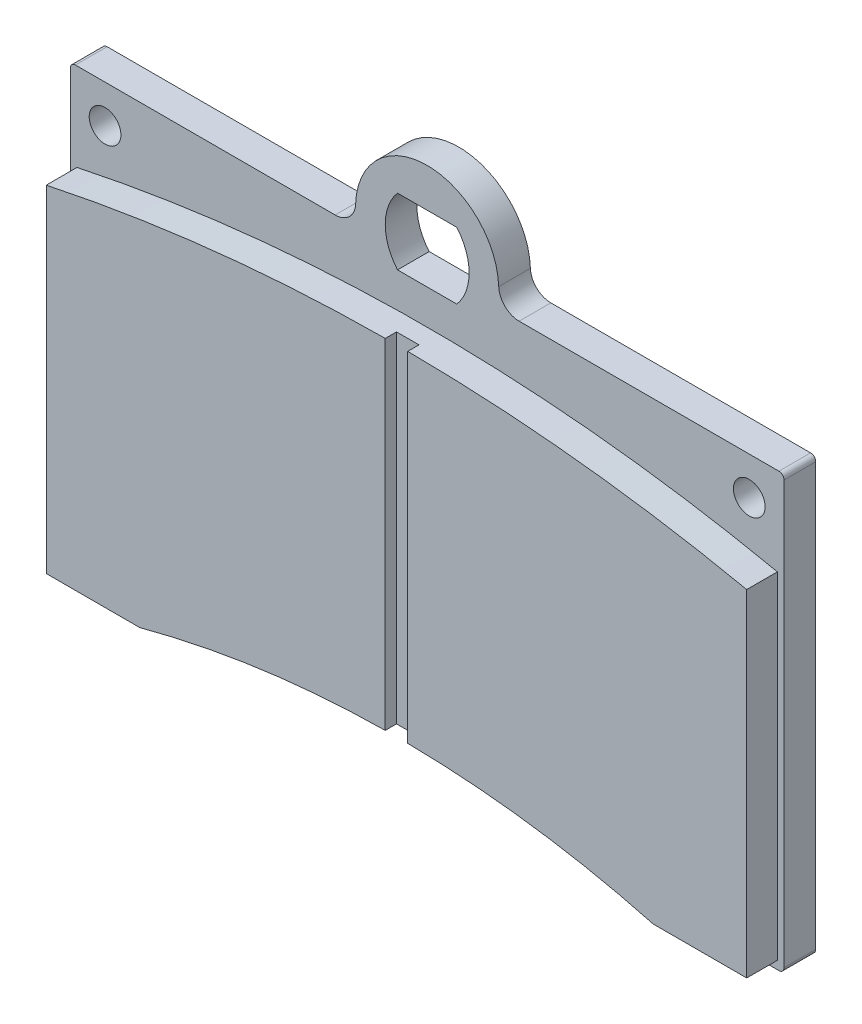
from build123d import *

# Parameters (mm, degrees)
SKETCH_1_W              = 69.8
SKETCH_1_H              = 42.3
EXTRUDE_1_DEPTH         = 3.1
CUT_EXTRUDE_1_DEPTH     = 82.675822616
EXTRUDE_2_DEPTH         = 3
SKETCH_4_W              = 2.2
SKETCH_4_H              = 33.206227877
CUT_EXTRUDE_2_DEPTH     = 1.1
SKETCH_5_R              = 7
EXTRUDE_3_DEPTH         = 3.1
FILLET_1_R              = 2
CUT_EXTRUDE_3_DEPTH     = 87.502312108
HOLE_WIZARD_3_1_3_1_1_D = 3.1
FILLET_2_R              = 0.5


with BuildPart() as part:
    # Sketch 1 → Extrude 1 (new body)
    with BuildSketch(Plane.XY):
        with Locations((34.9, 21.15)):
            Rectangle(SKETCH_1_W, SKETCH_1_H)
    extrude(amount=EXTRUDE_1_DEPTH)

    # Sketch 3 → Cut-Extrude 1 (cut, through all)
    with BuildSketch(Plane.XY.offset(3.1)):
        with BuildLine():
            Line((9.9, 0), (59.9, 0))
            ThreePointArc((59.9, 0), (34.9, 3.3), (9.9, 0))
        make_face()
    extrude(amount=-CUT_EXTRUDE_1_DEPTH, mode=Mode.SUBTRACT)

    # Sketch 2 → Extrude 2 (add)
    with BuildSketch(Plane.XY.offset(3.1)):
        with BuildLine():
            Line((0.65, 33.7), (0.65, 0.8))
            Line((0.65, 0.8), (9.79462209, 0.8))
            ThreePointArc((9.79462209, 0.8), (34.9, 4.1), (60.00537791, 0.8))
            Line((60.00537791, 0.8), (69.15, 0.8))
            Line((69.15, 0.8), (69.15, 33.7))
            ThreePointArc((69.15, 33.7), (34.9, 37.3), (0.65, 33.7))
        make_face()
    extrude(amount=EXTRUDE_2_DEPTH)

    # Sketch 4 → Cut-Extrude 2 (cut)
    with BuildSketch(Plane.XY.offset(6.1)):
        with Locations((34.9, 20.696886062)):
            Rectangle(SKETCH_4_W, SKETCH_4_H)
    extrude(amount=-CUT_EXTRUDE_2_DEPTH, mode=Mode.SUBTRACT)

    # Sketch 5 → Extrude 3 (add)
    with BuildSketch(Plane.XY.offset(3.1)):
        with Locations((34.9, 44)):
            Circle(SKETCH_5_R)
    extrude(amount=-EXTRUDE_3_DEPTH)

    # Fillet 1
    fillet_1_edges = [part.edges().sort_by_distance(p)[0] for p in [
        (41.690434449, 42.3, 1.55),
        (28.109565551, 42.3, 1.55),
    ]]
    fillet(fillet_1_edges, radius=FILLET_1_R)

    # Sketch 6 → Cut-Extrude 3 (cut, through all)
    with BuildSketch(Plane.XY.offset(3.1)):
        with BuildLine():
            Line((32, 47.2), (37.8, 47.2))
            ThreePointArc((37.8, 47.2), (39, 43.95), (37.8, 40.7))
            Line((37.8, 40.7), (32, 40.7))
            ThreePointArc((32, 40.7), (30.8, 43.95), (32, 47.2))
        make_face()
    extrude(amount=-CUT_EXTRUDE_3_DEPTH, mode=Mode.SUBTRACT)

    # Hole Wizard 3.1 _3.1_ _1 (through all)
    with Locations(Plane.XY.offset(3.1)):
        with Locations((66.4, 38.6), (3.4, 38.6)):
            Hole(HOLE_WIZARD_3_1_3_1_1_D / 2)

    # Fillet 2
    fillet_2_edges = [part.edges().sort_by_distance(p)[0] for p in [
        (0, 42.3, 1.55),
        (69.8, 42.3, 1.55),
        (69.8, 0, 1.55),
        (0, 0, 1.55),
    ]]
    fillet(fillet_2_edges, radius=FILLET_2_R)


solid = part.part
